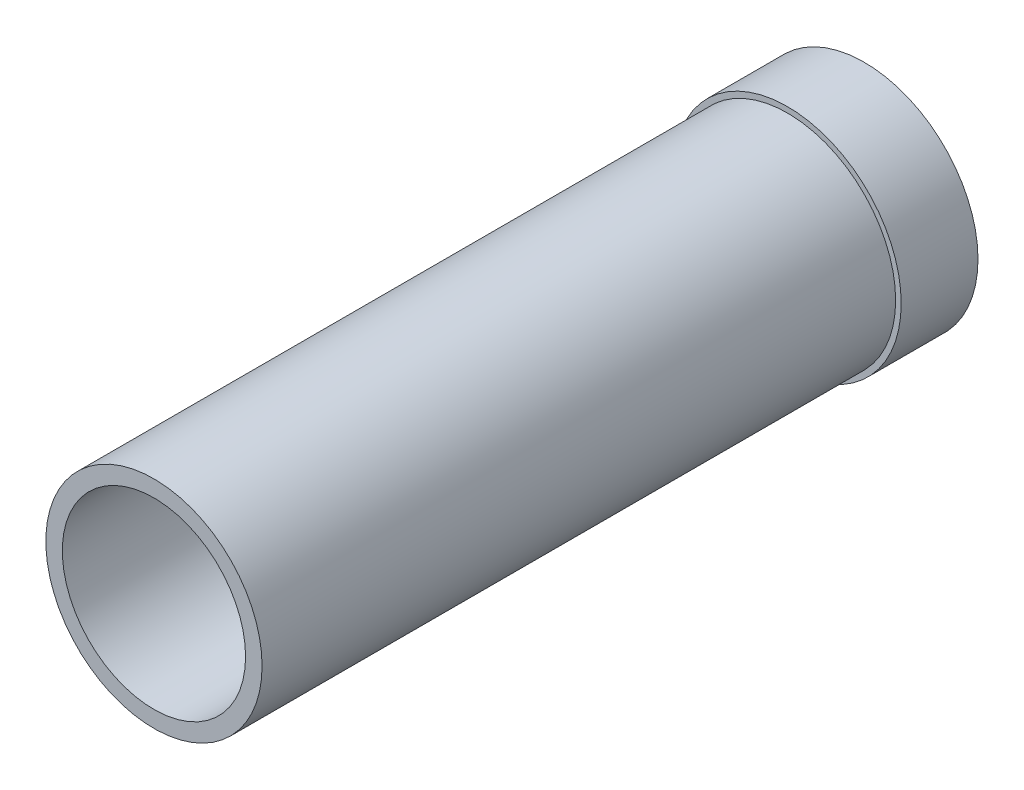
ISO-10303-21;
HEADER;
FILE_DESCRIPTION(('STEP AP214'),'2;1');
FILE_NAME('part.step','',(''),(''),'','','');
FILE_SCHEMA(('AUTOMOTIVE_DESIGN { 1 0 10303 214 1 1 1 1 }'));
ENDSEC;
DATA;
#1=APPLICATION_CONTEXT('core data for automotive mechanical design processes');
#2=APPLICATION_PROTOCOL_DEFINITION('international standard','automotive_design',2000,#1);
#3=PRODUCT_CONTEXT('',#1,'mechanical');
#4=PRODUCT('Part','Part','',(#3));
#5=PRODUCT_RELATED_PRODUCT_CATEGORY('part','',(#4));
#6=PRODUCT_DEFINITION_FORMATION('','',#4);
#7=PRODUCT_DEFINITION_CONTEXT('part definition',#1,'design');
#8=PRODUCT_DEFINITION('design','',#6,#7);
#9=PRODUCT_DEFINITION_SHAPE('','',#8);
#10=(LENGTH_UNIT() NAMED_UNIT(*) SI_UNIT(.MILLI.,.METRE.));
#11=(NAMED_UNIT(*) PLANE_ANGLE_UNIT() SI_UNIT($,.RADIAN.));
#12=(NAMED_UNIT(*) SI_UNIT($,.STERADIAN.) SOLID_ANGLE_UNIT());
#13=UNCERTAINTY_MEASURE_WITH_UNIT(LENGTH_MEASURE(1.E-05),#10,'distance_accuracy_value','');
#14=(GEOMETRIC_REPRESENTATION_CONTEXT(3) GLOBAL_UNCERTAINTY_ASSIGNED_CONTEXT((#13)) GLOBAL_UNIT_ASSIGNED_CONTEXT((#10,
#11,#12)) REPRESENTATION_CONTEXT('',''));
#15=CARTESIAN_POINT('',(0.,0.,0.));
#16=DIRECTION('',(0.,0.,1.));
#17=DIRECTION('',(1.,0.,0.));
#18=AXIS2_PLACEMENT_3D('',#15,#16,#17);
#19=CARTESIAN_POINT('',(0.,0.,0.));
#20=DIRECTION('',(0.,0.,1.));
#21=DIRECTION('',(1.,0.,0.));
#22=AXIS2_PLACEMENT_3D('',#19,#20,#21);
#23=PLANE('',#22);
#24=CARTESIAN_POINT('',(0.,0.,0.));
#25=DIRECTION('',(0.,0.,1.));
#26=DIRECTION('',(1.,0.,0.));
#27=AXIS2_PLACEMENT_3D('',#24,#25,#26);
#28=CIRCLE('',#27,14.2875);
#29=CARTESIAN_POINT('',(14.2875,0.,0.));
#30=VERTEX_POINT('',#29);
#31=EDGE_CURVE('E54',#30,#30,#28,.T.);
#32=ORIENTED_EDGE('',*,*,#31,.F.);
#33=EDGE_LOOP('',(#32));
#34=FACE_BOUND('',#33,.T.);
#35=CARTESIAN_POINT('',(0.,0.,0.));
#36=DIRECTION('',(0.,0.,1.));
#37=DIRECTION('',(1.,0.,0.));
#38=AXIS2_PLACEMENT_3D('',#35,#36,#37);
#39=CIRCLE('',#38,3.175);
#40=CARTESIAN_POINT('',(3.175,0.,0.));
#41=VERTEX_POINT('',#40);
#42=EDGE_CURVE('E10',#41,#41,#39,.F.);
#43=ORIENTED_EDGE('',*,*,#42,.F.);
#44=EDGE_LOOP('',(#43));
#45=FACE_BOUND('',#44,.T.);
#46=ADVANCED_FACE('F28',(#34,#45),#23,.F.);
#47=CARTESIAN_POINT('',(0.,0.,89.281));
#48=DIRECTION('',(0.,0.,1.));
#49=DIRECTION('',(1.,0.,0.));
#50=AXIS2_PLACEMENT_3D('',#47,#48,#49);
#51=PLANE('',#50);
#52=CARTESIAN_POINT('',(0.,0.,89.281));
#53=DIRECTION('',(0.,0.,1.));
#54=DIRECTION('',(1.,0.,0.));
#55=AXIS2_PLACEMENT_3D('',#52,#53,#54);
#56=CIRCLE('',#55,13.589);
#57=CARTESIAN_POINT('',(13.589,0.,89.281));
#58=VERTEX_POINT('',#57);
#59=EDGE_CURVE('E39',#58,#58,#56,.T.);
#60=ORIENTED_EDGE('',*,*,#59,.T.);
#61=EDGE_LOOP('',(#60));
#62=FACE_BOUND('',#61,.T.);
#63=CARTESIAN_POINT('',(0.,0.,89.281));
#64=DIRECTION('',(0.,0.,1.));
#65=DIRECTION('',(1.,0.,0.));
#66=AXIS2_PLACEMENT_3D('',#63,#64,#65);
#67=CIRCLE('',#66,11.51636);
#68=CARTESIAN_POINT('',(11.51636,0.,89.281));
#69=VERTEX_POINT('',#68);
#70=EDGE_CURVE('E43',#69,#69,#67,.T.);
#71=ORIENTED_EDGE('',*,*,#70,.F.);
#72=EDGE_LOOP('',(#71));
#73=FACE_BOUND('',#72,.T.);
#74=ADVANCED_FACE('F87',(#62,#73),#51,.T.);
#75=CARTESIAN_POINT('',(0.,0.,89.281));
#76=DIRECTION('',(0.,0.,-1.));
#77=DIRECTION('',(-1.,0.,0.));
#78=AXIS2_PLACEMENT_3D('',#75,#76,#77);
#79=CYLINDRICAL_SURFACE('',#78,13.589);
#80=CARTESIAN_POINT('',(0.,0.,9.65199999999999));
#81=DIRECTION('',(0.,0.,1.));
#82=DIRECTION('',(1.,0.,0.));
#83=AXIS2_PLACEMENT_3D('',#80,#81,#82);
#84=CIRCLE('',#83,13.589);
#85=CARTESIAN_POINT('',(13.589,0.,9.65199999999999));
#86=VERTEX_POINT('',#85);
#87=EDGE_CURVE('E48',#86,#86,#84,.T.);
#88=ORIENTED_EDGE('',*,*,#87,.T.);
#89=EDGE_LOOP('',(#88));
#90=FACE_BOUND('',#89,.T.);
#91=ORIENTED_EDGE('',*,*,#59,.F.);
#92=EDGE_LOOP('',(#91));
#93=FACE_BOUND('',#92,.T.);
#94=ADVANCED_FACE('F30',(#90,#93),#79,.T.);
#95=CARTESIAN_POINT('',(0.,0.,89.281));
#96=DIRECTION('',(0.,0.,-1.));
#97=DIRECTION('',(-1.,0.,0.));
#98=AXIS2_PLACEMENT_3D('',#95,#96,#97);
#99=CYLINDRICAL_SURFACE('',#98,11.51636);
#100=CARTESIAN_POINT('',(0.,0.,9.65199999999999));
#101=DIRECTION('',(0.,0.,1.));
#102=DIRECTION('',(1.,0.,0.));
#103=AXIS2_PLACEMENT_3D('',#100,#101,#102);
#104=CIRCLE('',#103,11.51636);
#105=CARTESIAN_POINT('',(11.51636,0.,9.65199999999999));
#106=VERTEX_POINT('',#105);
#107=EDGE_CURVE('E35',#106,#106,#104,.T.);
#108=ORIENTED_EDGE('',*,*,#107,.F.);
#109=EDGE_LOOP('',(#108));
#110=FACE_BOUND('',#109,.T.);
#111=ORIENTED_EDGE('',*,*,#70,.T.);
#112=EDGE_LOOP('',(#111));
#113=FACE_BOUND('',#112,.T.);
#114=ADVANCED_FACE('F97',(#110,#113),#99,.F.);
#115=CARTESIAN_POINT('',(0.,0.,9.652));
#116=DIRECTION('',(0.,0.,1.));
#117=DIRECTION('',(1.,0.,0.));
#118=AXIS2_PLACEMENT_3D('',#115,#116,#117);
#119=PLANE('',#118);
#120=CARTESIAN_POINT('',(0.,0.,9.65199999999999));
#121=DIRECTION('',(0.,0.,1.));
#122=DIRECTION('',(1.,0.,0.));
#123=AXIS2_PLACEMENT_3D('',#120,#121,#122);
#124=CIRCLE('',#123,0.9652);
#125=CARTESIAN_POINT('',(0.9652,0.,9.65199999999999));
#126=VERTEX_POINT('',#125);
#127=EDGE_CURVE('E60',#126,#126,#124,.T.);
#128=ORIENTED_EDGE('',*,*,#127,.F.);
#129=EDGE_LOOP('',(#128));
#130=FACE_BOUND('',#129,.T.);
#131=ORIENTED_EDGE('',*,*,#107,.T.);
#132=EDGE_LOOP('',(#131));
#133=FACE_BOUND('',#132,.T.);
#134=ADVANCED_FACE('F99',(#130,#133),#119,.T.);
#135=CARTESIAN_POINT('',(0.,0.,9.652));
#136=DIRECTION('',(0.,0.,1.));
#137=DIRECTION('',(1.,0.,0.));
#138=AXIS2_PLACEMENT_3D('',#135,#136,#137);
#139=CIRCLE('',#138,14.2875);
#140=CARTESIAN_POINT('',(14.2875,0.,9.652));
#141=VERTEX_POINT('',#140);
#142=EDGE_CURVE('E51',#141,#141,#139,.T.);
#143=ORIENTED_EDGE('',*,*,#142,.T.);
#144=EDGE_LOOP('',(#143));
#145=FACE_BOUND('',#144,.T.);
#146=ORIENTED_EDGE('',*,*,#87,.F.);
#147=EDGE_LOOP('',(#146));
#148=FACE_BOUND('',#147,.T.);
#149=ADVANCED_FACE('F82',(#145,#148),#119,.T.);
#150=CARTESIAN_POINT('',(0.,0.,9.652));
#151=DIRECTION('',(0.,0.,-1.));
#152=DIRECTION('',(-1.,0.,0.));
#153=AXIS2_PLACEMENT_3D('',#150,#151,#152);
#154=CYLINDRICAL_SURFACE('',#153,14.2875);
#155=ORIENTED_EDGE('',*,*,#142,.F.);
#156=EDGE_LOOP('',(#155));
#157=FACE_BOUND('',#156,.T.);
#158=ORIENTED_EDGE('',*,*,#31,.T.);
#159=EDGE_LOOP('',(#158));
#160=FACE_BOUND('',#159,.T.);
#161=ADVANCED_FACE('F77',(#157,#160),#154,.T.);
#162=CARTESIAN_POINT('',(0.,0.,-7.366));
#163=DIRECTION('',(0.,0.,1.));
#164=DIRECTION('',(1.,0.,0.));
#165=AXIS2_PLACEMENT_3D('',#162,#163,#164);
#166=CYLINDRICAL_SURFACE('',#165,3.175);
#167=CARTESIAN_POINT('',(0.,0.,-7.366));
#168=DIRECTION('',(0.,0.,-1.));
#169=DIRECTION('',(-1.,0.,0.));
#170=AXIS2_PLACEMENT_3D('',#167,#168,#169);
#171=CIRCLE('',#170,3.175);
#172=CARTESIAN_POINT('',(-3.175,0.,-7.366));
#173=VERTEX_POINT('',#172);
#174=EDGE_CURVE('E57',#173,#173,#171,.T.);
#175=ORIENTED_EDGE('',*,*,#174,.F.);
#176=EDGE_LOOP('',(#175));
#177=FACE_BOUND('',#176,.T.);
#178=ORIENTED_EDGE('',*,*,#42,.T.);
#179=EDGE_LOOP('',(#178));
#180=FACE_BOUND('',#179,.T.);
#181=ADVANCED_FACE('F72',(#177,#180),#166,.T.);
#182=CARTESIAN_POINT('',(0.,0.,-7.366));
#183=DIRECTION('',(0.,0.,-1.));
#184=DIRECTION('',(-1.,0.,0.));
#185=AXIS2_PLACEMENT_3D('',#182,#183,#184);
#186=PLANE('',#185);
#187=CARTESIAN_POINT('',(0.,0.,-7.366));
#188=DIRECTION('',(0.,0.,-1.));
#189=DIRECTION('',(-1.,0.,0.));
#190=AXIS2_PLACEMENT_3D('',#187,#188,#189);
#191=CIRCLE('',#190,0.9652);
#192=CARTESIAN_POINT('',(-0.9652,0.,-7.366));
#193=VERTEX_POINT('',#192);
#194=EDGE_CURVE('E63',#193,#193,#191,.T.);
#195=ORIENTED_EDGE('',*,*,#194,.F.);
#196=EDGE_LOOP('',(#195));
#197=FACE_BOUND('',#196,.T.);
#198=ORIENTED_EDGE('',*,*,#174,.T.);
#199=EDGE_LOOP('',(#198));
#200=FACE_BOUND('',#199,.T.);
#201=ADVANCED_FACE('F69',(#197,#200),#186,.T.);
#202=CARTESIAN_POINT('',(0.,0.,89.281));
#203=DIRECTION('',(0.,0.,-1.));
#204=DIRECTION('',(-1.,0.,0.));
#205=AXIS2_PLACEMENT_3D('',#202,#203,#204);
#206=CYLINDRICAL_SURFACE('',#205,0.9652);
#207=ORIENTED_EDGE('',*,*,#127,.T.);
#208=EDGE_LOOP('',(#207));
#209=FACE_BOUND('',#208,.T.);
#210=ORIENTED_EDGE('',*,*,#194,.T.);
#211=EDGE_LOOP('',(#210));
#212=FACE_BOUND('',#211,.T.);
#213=ADVANCED_FACE('F67',(#209,#212),#206,.F.);
#214=CLOSED_SHELL('',(#46,#74,#94,#114,#134,#149,#161,#181,#201,#213));
#215=MANIFOLD_SOLID_BREP('B2',#214);
#216=ADVANCED_BREP_SHAPE_REPRESENTATION('',(#18,#215),#14);
#217=SHAPE_DEFINITION_REPRESENTATION(#9,#216);
ENDSEC;
END-ISO-10303-21;
